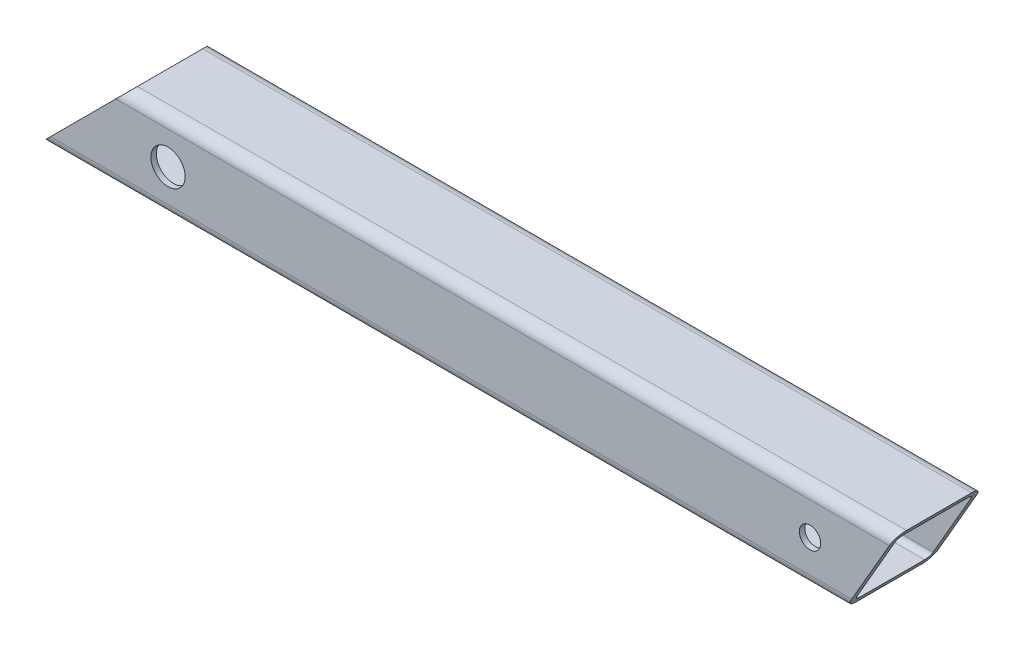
from build123d import *

# Parameters (mm, degrees)
STRUCTURAL_MEMBER1_DEPTH = 1000
CUT_EXTRUDE2_DEPTH       = 1003.577318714
CUT_EXTRUDE2_DEPTH_BACK  = 1003.577318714
CUT_EXTRUDE5_DEPTH       = 1003.577318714
CUT_EXTRUDE5_DEPTH_BACK  = 1003.577318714
SKETCH15_R               = 20
SKETCH15_R_2             = 12.5
CUT_EXTRUDE6_DEPTH       = 1007.430921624


with BuildPart() as part:
    # Sketch129 → Structural Member1 (new body)
    with BuildSketch(Plane(origin=(0, 0, 0), x_dir=(0, 0, -1), z_dir=(1, 0, 0))):
        with BuildLine():
            Line((-38.1, 50.8), (38.1, 50.8))
            ThreePointArc((38.1, 50.8), (47.080256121, 47.080256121), (50.8, 38.1))
            Line((50.8, 38.1), (50.8, -38.1))
            ThreePointArc((50.8, -38.1), (47.080256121, -47.080256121), (38.1, -50.8))
            Line((38.1, -50.8), (-38.1, -50.8))
            ThreePointArc((-38.1, -50.8), (-47.080256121, -47.080256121), (-50.8, -38.1))
            Line((-50.8, -38.1), (-50.8, 38.1))
            ThreePointArc((-50.8, 38.1), (-47.080256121, 47.080256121), (-38.1, 50.8))
        make_face()
        with BuildLine():
            Line((-38.1, 44.45), (38.1, 44.45))
            ThreePointArc((38.1, 44.45), (42.590128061, 42.590128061), (44.45, 38.1))
            Line((44.45, 38.1), (44.45, -38.1))
            ThreePointArc((44.45, -38.1), (42.590128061, -42.590128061), (38.1, -44.45))
            Line((38.1, -44.45), (-38.1, -44.45))
            ThreePointArc((-38.1, -44.45), (-42.590128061, -42.590128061), (-44.45, -38.1))
            Line((-44.45, -38.1), (-44.45, 38.1))
            ThreePointArc((-44.45, 38.1), (-42.590128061, 42.590128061), (-38.1, 44.45))
        make_face(mode=Mode.SUBTRACT)
    extrude(amount=STRUCTURAL_MEMBER1_DEPTH)

    # Sketch13 → Cut-Extrude2 (cut, two sides: drawn at the far end of the back side and taken through both)
    with BuildSketch(Plane.XY.offset(-CUT_EXTRUDE2_DEPTH_BACK)):
        Polygon((-1428.565042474, -1479.365042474), (0, -50.8), (101.6, 50.8), (1530.165042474, 1479.365042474), (-1326.965042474, 4336.495127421), (-4285.695127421, 1377.765042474), align=None)
    extrude(amount=CUT_EXTRUDE2_DEPTH + CUT_EXTRUDE2_DEPTH_BACK, mode=Mode.SUBTRACT)

    # Sketch14 → Cut-Extrude5 (cut, two sides: drawn at the far end of the back side and taken through both)
    with BuildSketch(Plane.XY.offset(-CUT_EXTRUDE5_DEPTH_BACK)):
        Polygon((2010.148028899, 1800.427709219), (1000, 50.8), (941.34121265, -50.8), (-68.806816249, -1800.427709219), (3430.448602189, -3820.723767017), (5509.403447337, -219.868348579), align=None)
    extrude(amount=CUT_EXTRUDE5_DEPTH + CUT_EXTRUDE5_DEPTH_BACK, mode=Mode.SUBTRACT)

    # Sketch15 → Cut-Extrude6 (cut, through all)
    with BuildSketch(Plane.XY.offset(50.8)):
        with Locations((150, 0)):
            Circle(SKETCH15_R)
        with Locations((900, 0)):
            Circle(SKETCH15_R_2)
    extrude(amount=-CUT_EXTRUDE6_DEPTH, mode=Mode.SUBTRACT)


solid = part.part
